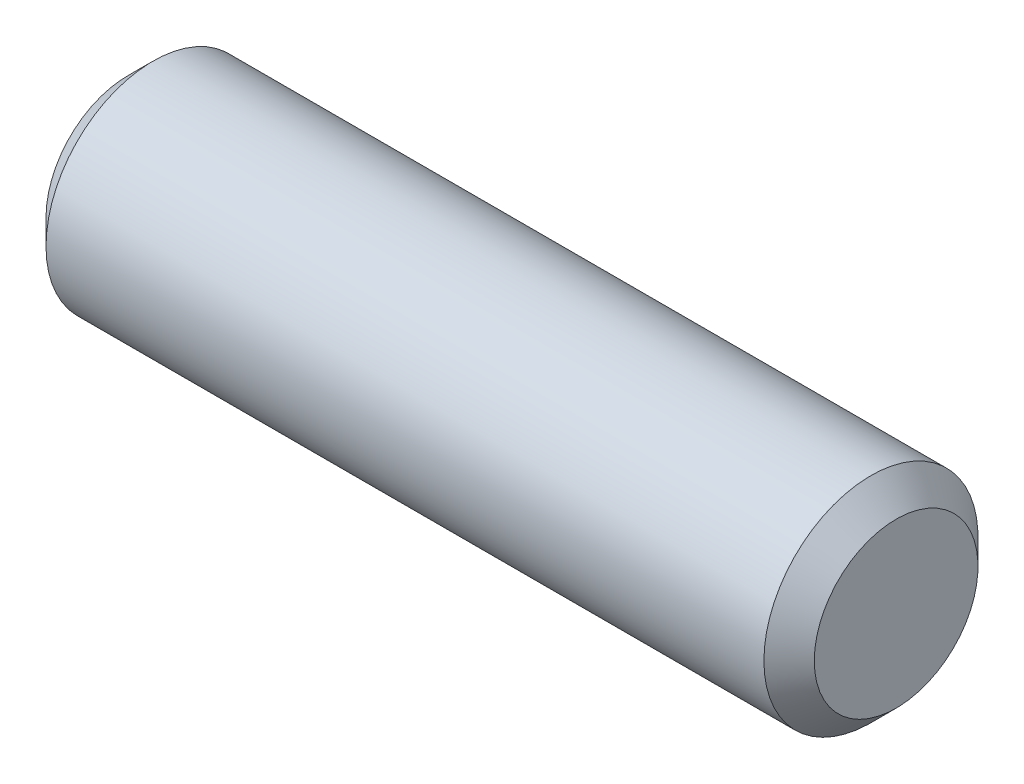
from build123d import *


with BuildPart() as part:
    # Sketch2 → Revolve1 (revolve)
    with BuildSketch(Plane.XY, mode=Mode.PRIVATE) as revolve1_sk:
        Polygon((0, 0), (0, 0.8255), (0.254, 1.0795), (7.493, 1.0795), (7.747, 0.8255), (7.747, 0), align=None)
    revolve(revolve1_sk.sketch.rotate(Axis((0, 0, 0), (1, 0, 0)), 90), axis=Axis((0, 0, 0), (1, 0, 0)))


solid = part.part
